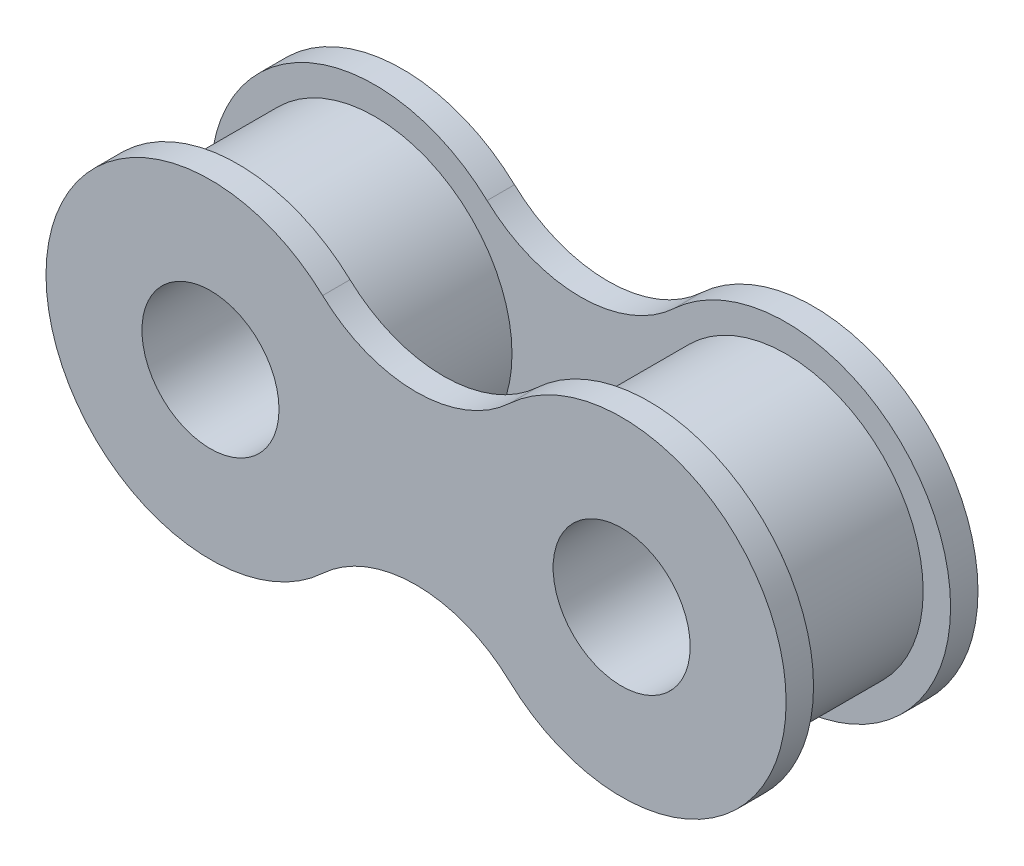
ISO-10303-21;
HEADER;
FILE_DESCRIPTION(('STEP AP214'),'2;1');
FILE_NAME('part.step','',(''),(''),'','','');
FILE_SCHEMA(('AUTOMOTIVE_DESIGN { 1 0 10303 214 1 1 1 1 }'));
ENDSEC;
DATA;
#1=APPLICATION_CONTEXT('core data for automotive mechanical design processes');
#2=APPLICATION_PROTOCOL_DEFINITION('international standard','automotive_design',2000,#1);
#3=PRODUCT_CONTEXT('',#1,'mechanical');
#4=PRODUCT('Part','Part','',(#3));
#5=PRODUCT_RELATED_PRODUCT_CATEGORY('part','',(#4));
#6=PRODUCT_DEFINITION_FORMATION('','',#4);
#7=PRODUCT_DEFINITION_CONTEXT('part definition',#1,'design');
#8=PRODUCT_DEFINITION('design','',#6,#7);
#9=PRODUCT_DEFINITION_SHAPE('','',#8);
#10=(LENGTH_UNIT() NAMED_UNIT(*) SI_UNIT(.MILLI.,.METRE.));
#11=(NAMED_UNIT(*) PLANE_ANGLE_UNIT() SI_UNIT($,.RADIAN.));
#12=(NAMED_UNIT(*) SI_UNIT($,.STERADIAN.) SOLID_ANGLE_UNIT());
#13=UNCERTAINTY_MEASURE_WITH_UNIT(LENGTH_MEASURE(1.E-05),#10,'distance_accuracy_value','');
#14=(GEOMETRIC_REPRESENTATION_CONTEXT(3) GLOBAL_UNCERTAINTY_ASSIGNED_CONTEXT((#13)) GLOBAL_UNIT_ASSIGNED_CONTEXT((#10,
#11,#12)) REPRESENTATION_CONTEXT('',''));
#15=CARTESIAN_POINT('',(0.,0.,0.));
#16=DIRECTION('',(0.,0.,1.));
#17=DIRECTION('',(1.,0.,0.));
#18=AXIS2_PLACEMENT_3D('',#15,#16,#17);
#19=CARTESIAN_POINT('',(0.,0.,-2.5));
#20=DIRECTION('',(0.,0.,1.));
#21=DIRECTION('',(1.,0.,0.));
#22=AXIS2_PLACEMENT_3D('',#19,#20,#21);
#23=CYLINDRICAL_SURFACE('',#22,2.5);
#24=CARTESIAN_POINT('',(0.,0.,3.5));
#25=DIRECTION('',(0.,0.,1.));
#26=DIRECTION('',(1.,0.,0.));
#27=AXIS2_PLACEMENT_3D('',#24,#25,#26);
#28=CIRCLE('',#27,2.5);
#29=CARTESIAN_POINT('',(2.5,0.,3.5));
#30=VERTEX_POINT('',#29);
#31=EDGE_CURVE('E177',#30,#30,#28,.T.);
#32=ORIENTED_EDGE('',*,*,#31,.T.);
#33=EDGE_LOOP('',(#32));
#34=FACE_BOUND('',#33,.T.);
#35=CARTESIAN_POINT('',(0.,0.,-3.5));
#36=DIRECTION('',(0.,0.,1.));
#37=DIRECTION('',(1.,0.,0.));
#38=AXIS2_PLACEMENT_3D('',#35,#36,#37);
#39=CIRCLE('',#38,2.5);
#40=CARTESIAN_POINT('',(2.5,0.,-3.5));
#41=VERTEX_POINT('',#40);
#42=EDGE_CURVE('E141',#41,#41,#39,.T.);
#43=ORIENTED_EDGE('',*,*,#42,.F.);
#44=EDGE_LOOP('',(#43));
#45=FACE_BOUND('',#44,.T.);
#46=ADVANCED_FACE('F37',(#34,#45),#23,.F.);
#47=CARTESIAN_POINT('',(0.,0.,-2.5));
#48=DIRECTION('',(0.,0.,1.));
#49=DIRECTION('',(1.,0.,0.));
#50=AXIS2_PLACEMENT_3D('',#47,#48,#49);
#51=CYLINDRICAL_SURFACE('',#50,5.);
#52=CARTESIAN_POINT('',(0.,0.,-2.5));
#53=DIRECTION('',(0.,0.,-1.));
#54=DIRECTION('',(-1.,0.,0.));
#55=AXIS2_PLACEMENT_3D('',#52,#53,#54);
#56=CIRCLE('',#55,5.);
#57=CARTESIAN_POINT('',(-5.,0.,-2.5));
#58=VERTEX_POINT('',#57);
#59=EDGE_CURVE('E162',#58,#58,#56,.F.);
#60=ORIENTED_EDGE('',*,*,#59,.T.);
#61=EDGE_LOOP('',(#60));
#62=FACE_BOUND('',#61,.T.);
#63=CARTESIAN_POINT('',(0.,0.,2.5));
#64=DIRECTION('',(0.,0.,1.));
#65=DIRECTION('',(1.,0.,0.));
#66=AXIS2_PLACEMENT_3D('',#63,#64,#65);
#67=CIRCLE('',#66,5.);
#68=CARTESIAN_POINT('',(5.,0.,2.5));
#69=VERTEX_POINT('',#68);
#70=EDGE_CURVE('E11',#69,#69,#67,.T.);
#71=ORIENTED_EDGE('',*,*,#70,.F.);
#72=EDGE_LOOP('',(#71));
#73=FACE_BOUND('',#72,.T.);
#74=ADVANCED_FACE('F202',(#62,#73),#51,.T.);
#75=CARTESIAN_POINT('',(7.5,8.04673846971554,3.5));
#76=DIRECTION('',(0.,0.,-1.));
#77=DIRECTION('',(-1.,0.,0.));
#78=AXIS2_PLACEMENT_3D('',#75,#76,#77);
#79=CYLINDRICAL_SURFACE('',#78,5.);
#80=CARTESIAN_POINT('',(7.5,8.04673846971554,2.5));
#81=DIRECTION('',(0.,0.,1.));
#82=DIRECTION('',(1.,0.,0.));
#83=AXIS2_PLACEMENT_3D('',#80,#81,#82);
#84=CIRCLE('',#83,5.);
#85=CARTESIAN_POINT('',(4.09090909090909,4.3891300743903,2.5));
#86=VERTEX_POINT('',#85);
#87=CARTESIAN_POINT('',(10.9090909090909,4.3891300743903,2.5));
#88=VERTEX_POINT('',#87);
#89=EDGE_CURVE('E168',#86,#88,#84,.T.);
#90=ORIENTED_EDGE('',*,*,#89,.F.);
#91=DIRECTION('',(0.,0.,-1.));
#92=VECTOR('',#91,1.);
#93=CARTESIAN_POINT('',(4.09090909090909,4.3891300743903,3.5));
#94=LINE('',#93,#92);
#95=CARTESIAN_POINT('',(4.09090909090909,4.3891300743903,3.5));
#96=VERTEX_POINT('',#95);
#97=EDGE_CURVE('E45',#96,#86,#94,.T.);
#98=ORIENTED_EDGE('',*,*,#97,.F.);
#99=CARTESIAN_POINT('',(7.5,8.04673846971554,3.5));
#100=DIRECTION('',(0.,0.,1.));
#101=DIRECTION('',(1.,0.,0.));
#102=AXIS2_PLACEMENT_3D('',#99,#100,#101);
#103=CIRCLE('',#102,5.);
#104=CARTESIAN_POINT('',(10.9090909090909,4.3891300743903,3.5));
#105=VERTEX_POINT('',#104);
#106=EDGE_CURVE('E169',#96,#105,#103,.T.);
#107=ORIENTED_EDGE('',*,*,#106,.T.);
#108=DIRECTION('',(0.,0.,-1.));
#109=VECTOR('',#108,1.);
#110=CARTESIAN_POINT('',(10.9090909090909,4.3891300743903,3.5));
#111=LINE('',#110,#109);
#112=EDGE_CURVE('E78',#105,#88,#111,.T.);
#113=ORIENTED_EDGE('',*,*,#112,.T.);
#114=EDGE_LOOP('',(#90,#98,#107,#113));
#115=FACE_BOUND('',#114,.T.);
#116=ADVANCED_FACE('F200',(#115),#79,.F.);
#117=CARTESIAN_POINT('',(0.,0.,3.5));
#118=DIRECTION('',(0.,0.,-1.));
#119=DIRECTION('',(-1.,0.,0.));
#120=AXIS2_PLACEMENT_3D('',#117,#118,#119);
#121=CYLINDRICAL_SURFACE('',#120,6.);
#122=CARTESIAN_POINT('',(0.,0.,2.5));
#123=DIRECTION('',(0.,0.,1.));
#124=DIRECTION('',(1.,0.,0.));
#125=AXIS2_PLACEMENT_3D('',#122,#123,#124);
#126=CIRCLE('',#125,6.);
#127=CARTESIAN_POINT('',(4.09090909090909,-4.3891300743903,2.5));
#128=VERTEX_POINT('',#127);
#129=EDGE_CURVE('E185',#86,#128,#126,.T.);
#130=ORIENTED_EDGE('',*,*,#129,.T.);
#131=DIRECTION('',(0.,0.,-1.));
#132=VECTOR('',#131,1.);
#133=CARTESIAN_POINT('',(4.09090909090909,-4.3891300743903,3.5));
#134=LINE('',#133,#132);
#135=CARTESIAN_POINT('',(4.09090909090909,-4.3891300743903,3.5));
#136=VERTEX_POINT('',#135);
#137=EDGE_CURVE('E192',#136,#128,#134,.T.);
#138=ORIENTED_EDGE('',*,*,#137,.F.);
#139=CARTESIAN_POINT('',(0.,0.,3.5));
#140=DIRECTION('',(0.,0.,1.));
#141=DIRECTION('',(1.,0.,0.));
#142=AXIS2_PLACEMENT_3D('',#139,#140,#141);
#143=CIRCLE('',#142,6.);
#144=EDGE_CURVE('E171',#96,#136,#143,.T.);
#145=ORIENTED_EDGE('',*,*,#144,.F.);
#146=ORIENTED_EDGE('',*,*,#97,.T.);
#147=EDGE_LOOP('',(#130,#138,#145,#146));
#148=FACE_BOUND('',#147,.T.);
#149=ADVANCED_FACE('F195',(#148),#121,.T.);
#150=CARTESIAN_POINT('',(7.5,-8.04673846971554,3.5));
#151=DIRECTION('',(0.,0.,-1.));
#152=DIRECTION('',(-1.,0.,0.));
#153=AXIS2_PLACEMENT_3D('',#150,#151,#152);
#154=CYLINDRICAL_SURFACE('',#153,5.);
#155=CARTESIAN_POINT('',(7.5,-8.04673846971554,2.5));
#156=DIRECTION('',(0.,0.,1.));
#157=DIRECTION('',(1.,0.,0.));
#158=AXIS2_PLACEMENT_3D('',#155,#156,#157);
#159=CIRCLE('',#158,5.);
#160=CARTESIAN_POINT('',(10.9090909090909,-4.3891300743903,2.5));
#161=VERTEX_POINT('',#160);
#162=EDGE_CURVE('E71',#128,#161,#159,.F.);
#163=ORIENTED_EDGE('',*,*,#162,.T.);
#164=DIRECTION('',(0.,0.,-1.));
#165=VECTOR('',#164,1.);
#166=CARTESIAN_POINT('',(10.9090909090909,-4.3891300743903,3.5));
#167=LINE('',#166,#165);
#168=CARTESIAN_POINT('',(10.9090909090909,-4.3891300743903,3.5));
#169=VERTEX_POINT('',#168);
#170=EDGE_CURVE('E190',#169,#161,#167,.T.);
#171=ORIENTED_EDGE('',*,*,#170,.F.);
#172=CARTESIAN_POINT('',(7.5,-8.04673846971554,3.5));
#173=DIRECTION('',(0.,0.,1.));
#174=DIRECTION('',(1.,0.,0.));
#175=AXIS2_PLACEMENT_3D('',#172,#173,#174);
#176=CIRCLE('',#175,5.);
#177=EDGE_CURVE('E174',#136,#169,#176,.F.);
#178=ORIENTED_EDGE('',*,*,#177,.F.);
#179=ORIENTED_EDGE('',*,*,#137,.T.);
#180=EDGE_LOOP('',(#163,#171,#178,#179));
#181=FACE_BOUND('',#180,.T.);
#182=ADVANCED_FACE('F208',(#181),#154,.F.);
#183=CARTESIAN_POINT('',(15.,0.,3.5));
#184=DIRECTION('',(0.,0.,-1.));
#185=DIRECTION('',(-1.,0.,0.));
#186=AXIS2_PLACEMENT_3D('',#183,#184,#185);
#187=CYLINDRICAL_SURFACE('',#186,6.);
#188=CARTESIAN_POINT('',(15.,0.,2.5));
#189=DIRECTION('',(0.,0.,1.));
#190=DIRECTION('',(1.,0.,0.));
#191=AXIS2_PLACEMENT_3D('',#188,#189,#190);
#192=CIRCLE('',#191,6.);
#193=EDGE_CURVE('E172',#161,#88,#192,.T.);
#194=ORIENTED_EDGE('',*,*,#193,.T.);
#195=ORIENTED_EDGE('',*,*,#112,.F.);
#196=CARTESIAN_POINT('',(15.,0.,3.5));
#197=DIRECTION('',(0.,0.,1.));
#198=DIRECTION('',(1.,0.,0.));
#199=AXIS2_PLACEMENT_3D('',#196,#197,#198);
#200=CIRCLE('',#199,6.);
#201=EDGE_CURVE('E53',#169,#105,#200,.T.);
#202=ORIENTED_EDGE('',*,*,#201,.F.);
#203=ORIENTED_EDGE('',*,*,#170,.T.);
#204=EDGE_LOOP('',(#194,#195,#202,#203));
#205=FACE_BOUND('',#204,.T.);
#206=ADVANCED_FACE('F228',(#205),#187,.T.);
#207=CARTESIAN_POINT('',(15.,0.,3.5));
#208=DIRECTION('',(0.,0.,-1.));
#209=DIRECTION('',(-1.,0.,0.));
#210=AXIS2_PLACEMENT_3D('',#207,#208,#209);
#211=CYLINDRICAL_SURFACE('',#210,2.49999999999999);
#212=CARTESIAN_POINT('',(15.,0.,3.5));
#213=DIRECTION('',(0.,0.,1.));
#214=DIRECTION('',(1.,0.,0.));
#215=AXIS2_PLACEMENT_3D('',#212,#213,#214);
#216=CIRCLE('',#215,2.49999999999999);
#217=CARTESIAN_POINT('',(17.5,0.,3.5));
#218=VERTEX_POINT('',#217);
#219=EDGE_CURVE('E180',#218,#218,#216,.T.);
#220=ORIENTED_EDGE('',*,*,#219,.T.);
#221=EDGE_LOOP('',(#220));
#222=FACE_BOUND('',#221,.T.);
#223=CARTESIAN_POINT('',(15.,0.,-3.5));
#224=DIRECTION('',(0.,0.,1.));
#225=DIRECTION('',(1.,0.,0.));
#226=AXIS2_PLACEMENT_3D('',#223,#224,#225);
#227=CIRCLE('',#226,2.49999999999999);
#228=CARTESIAN_POINT('',(17.5,0.,-3.5));
#229=VERTEX_POINT('',#228);
#230=EDGE_CURVE('E144',#229,#229,#227,.T.);
#231=ORIENTED_EDGE('',*,*,#230,.F.);
#232=EDGE_LOOP('',(#231));
#233=FACE_BOUND('',#232,.T.);
#234=ADVANCED_FACE('F225',(#222,#233),#211,.F.);
#235=CARTESIAN_POINT('',(7.5,-23.1232620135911,3.5));
#236=DIRECTION('',(0.,0.,1.));
#237=DIRECTION('',(1.,0.,0.));
#238=AXIS2_PLACEMENT_3D('',#235,#236,#237);
#239=PLANE('',#238);
#240=ORIENTED_EDGE('',*,*,#106,.F.);
#241=ORIENTED_EDGE('',*,*,#144,.T.);
#242=ORIENTED_EDGE('',*,*,#177,.T.);
#243=ORIENTED_EDGE('',*,*,#201,.T.);
#244=EDGE_LOOP('',(#240,#241,#242,#243));
#245=FACE_BOUND('',#244,.T.);
#246=ORIENTED_EDGE('',*,*,#31,.F.);
#247=EDGE_LOOP('',(#246));
#248=FACE_BOUND('',#247,.T.);
#249=ORIENTED_EDGE('',*,*,#219,.F.);
#250=EDGE_LOOP('',(#249));
#251=FACE_BOUND('',#250,.T.);
#252=ADVANCED_FACE('F227',(#245,#248,#251),#239,.T.);
#253=CARTESIAN_POINT('',(7.5,-23.1232620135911,2.5));
#254=DIRECTION('',(0.,0.,1.));
#255=DIRECTION('',(1.,0.,0.));
#256=AXIS2_PLACEMENT_3D('',#253,#254,#255);
#257=PLANE('',#256);
#258=CARTESIAN_POINT('',(15.,0.,2.5));
#259=DIRECTION('',(0.,0.,1.));
#260=DIRECTION('',(1.,0.,0.));
#261=AXIS2_PLACEMENT_3D('',#258,#259,#260);
#262=CIRCLE('',#261,5.);
#263=CARTESIAN_POINT('',(20.,0.,2.5));
#264=VERTEX_POINT('',#263);
#265=EDGE_CURVE('E165',#264,#264,#262,.T.);
#266=ORIENTED_EDGE('',*,*,#265,.T.);
#267=EDGE_LOOP('',(#266));
#268=FACE_BOUND('',#267,.T.);
#269=ORIENTED_EDGE('',*,*,#70,.T.);
#270=EDGE_LOOP('',(#269));
#271=FACE_BOUND('',#270,.T.);
#272=ORIENTED_EDGE('',*,*,#89,.T.);
#273=ORIENTED_EDGE('',*,*,#193,.F.);
#274=ORIENTED_EDGE('',*,*,#162,.F.);
#275=ORIENTED_EDGE('',*,*,#129,.F.);
#276=EDGE_LOOP('',(#272,#273,#274,#275));
#277=FACE_BOUND('',#276,.T.);
#278=ADVANCED_FACE('F198',(#268,#271,#277),#257,.F.);
#279=CARTESIAN_POINT('',(15.,0.,-2.5));
#280=DIRECTION('',(0.,0.,1.));
#281=DIRECTION('',(1.,0.,0.));
#282=AXIS2_PLACEMENT_3D('',#279,#280,#281);
#283=CYLINDRICAL_SURFACE('',#282,5.);
#284=CARTESIAN_POINT('',(15.,0.,-2.5));
#285=DIRECTION('',(0.,0.,-1.));
#286=DIRECTION('',(-1.,0.,0.));
#287=AXIS2_PLACEMENT_3D('',#284,#285,#286);
#288=CIRCLE('',#287,5.);
#289=CARTESIAN_POINT('',(9.99999999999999,0.,-2.5));
#290=VERTEX_POINT('',#289);
#291=EDGE_CURVE('E132',#290,#290,#288,.F.);
#292=ORIENTED_EDGE('',*,*,#291,.T.);
#293=EDGE_LOOP('',(#292));
#294=FACE_BOUND('',#293,.T.);
#295=ORIENTED_EDGE('',*,*,#265,.F.);
#296=EDGE_LOOP('',(#295));
#297=FACE_BOUND('',#296,.T.);
#298=ADVANCED_FACE('F267',(#294,#297),#283,.T.);
#299=CARTESIAN_POINT('',(7.5,8.04673846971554,-3.5));
#300=DIRECTION('',(0.,0.,1.));
#301=DIRECTION('',(1.,0.,0.));
#302=AXIS2_PLACEMENT_3D('',#299,#300,#301);
#303=CYLINDRICAL_SURFACE('',#302,5.);
#304=CARTESIAN_POINT('',(7.5,8.04673846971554,-2.5));
#305=DIRECTION('',(0.,0.,1.));
#306=DIRECTION('',(1.,0.,0.));
#307=AXIS2_PLACEMENT_3D('',#304,#305,#306);
#308=CIRCLE('',#307,5.);
#309=CARTESIAN_POINT('',(4.09090909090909,4.3891300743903,-2.5));
#310=VERTEX_POINT('',#309);
#311=CARTESIAN_POINT('',(10.9090909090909,4.3891300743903,-2.5));
#312=VERTEX_POINT('',#311);
#313=EDGE_CURVE('E128',#310,#312,#308,.T.);
#314=ORIENTED_EDGE('',*,*,#313,.T.);
#315=DIRECTION('',(0.,0.,1.));
#316=VECTOR('',#315,1.);
#317=CARTESIAN_POINT('',(10.9090909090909,4.3891300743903,-3.5));
#318=LINE('',#317,#316);
#319=CARTESIAN_POINT('',(10.9090909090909,4.3891300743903,-3.5));
#320=VERTEX_POINT('',#319);
#321=EDGE_CURVE('E125',#320,#312,#318,.T.);
#322=ORIENTED_EDGE('',*,*,#321,.F.);
#323=CARTESIAN_POINT('',(7.5,8.04673846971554,-3.5));
#324=DIRECTION('',(0.,0.,1.));
#325=DIRECTION('',(1.,0.,0.));
#326=AXIS2_PLACEMENT_3D('',#323,#324,#325);
#327=CIRCLE('',#326,5.);
#328=CARTESIAN_POINT('',(4.09090909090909,4.3891300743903,-3.5));
#329=VERTEX_POINT('',#328);
#330=EDGE_CURVE('E111',#329,#320,#327,.T.);
#331=ORIENTED_EDGE('',*,*,#330,.F.);
#332=DIRECTION('',(0.,0.,1.));
#333=VECTOR('',#332,1.);
#334=CARTESIAN_POINT('',(4.09090909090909,4.3891300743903,-3.5));
#335=LINE('',#334,#333);
#336=EDGE_CURVE('E147',#329,#310,#335,.T.);
#337=ORIENTED_EDGE('',*,*,#336,.T.);
#338=EDGE_LOOP('',(#314,#322,#331,#337));
#339=FACE_BOUND('',#338,.T.);
#340=ADVANCED_FACE('F126',(#339),#303,.F.);
#341=CARTESIAN_POINT('',(15.,0.,-3.5));
#342=DIRECTION('',(0.,0.,1.));
#343=DIRECTION('',(1.,0.,0.));
#344=AXIS2_PLACEMENT_3D('',#341,#342,#343);
#345=CYLINDRICAL_SURFACE('',#344,6.);
#346=CARTESIAN_POINT('',(15.,0.,-2.5));
#347=DIRECTION('',(0.,0.,1.));
#348=DIRECTION('',(1.,0.,0.));
#349=AXIS2_PLACEMENT_3D('',#346,#347,#348);
#350=CIRCLE('',#349,6.);
#351=CARTESIAN_POINT('',(10.9090909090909,-4.3891300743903,-2.5));
#352=VERTEX_POINT('',#351);
#353=EDGE_CURVE('E149',#352,#312,#350,.T.);
#354=ORIENTED_EDGE('',*,*,#353,.F.);
#355=DIRECTION('',(0.,0.,1.));
#356=VECTOR('',#355,1.);
#357=CARTESIAN_POINT('',(10.9090909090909,-4.3891300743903,-3.5));
#358=LINE('',#357,#356);
#359=CARTESIAN_POINT('',(10.9090909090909,-4.3891300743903,-3.5));
#360=VERTEX_POINT('',#359);
#361=EDGE_CURVE('E133',#360,#352,#358,.T.);
#362=ORIENTED_EDGE('',*,*,#361,.F.);
#363=CARTESIAN_POINT('',(15.,0.,-3.5));
#364=DIRECTION('',(0.,0.,1.));
#365=DIRECTION('',(1.,0.,0.));
#366=AXIS2_PLACEMENT_3D('',#363,#364,#365);
#367=CIRCLE('',#366,6.);
#368=EDGE_CURVE('E117',#360,#320,#367,.T.);
#369=ORIENTED_EDGE('',*,*,#368,.T.);
#370=ORIENTED_EDGE('',*,*,#321,.T.);
#371=EDGE_LOOP('',(#354,#362,#369,#370));
#372=FACE_BOUND('',#371,.T.);
#373=ADVANCED_FACE('F135',(#372),#345,.T.);
#374=CARTESIAN_POINT('',(7.5,-8.04673846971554,-3.5));
#375=DIRECTION('',(0.,0.,1.));
#376=DIRECTION('',(1.,0.,0.));
#377=AXIS2_PLACEMENT_3D('',#374,#375,#376);
#378=CYLINDRICAL_SURFACE('',#377,5.);
#379=CARTESIAN_POINT('',(7.5,-8.04673846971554,-2.5));
#380=DIRECTION('',(0.,0.,1.));
#381=DIRECTION('',(1.,0.,0.));
#382=AXIS2_PLACEMENT_3D('',#379,#380,#381);
#383=CIRCLE('',#382,5.);
#384=CARTESIAN_POINT('',(4.09090909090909,-4.3891300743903,-2.5));
#385=VERTEX_POINT('',#384);
#386=EDGE_CURVE('E151',#385,#352,#383,.F.);
#387=ORIENTED_EDGE('',*,*,#386,.F.);
#388=DIRECTION('',(0.,0.,1.));
#389=VECTOR('',#388,1.);
#390=CARTESIAN_POINT('',(4.09090909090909,-4.3891300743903,-3.5));
#391=LINE('',#390,#389);
#392=CARTESIAN_POINT('',(4.09090909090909,-4.3891300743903,-3.5));
#393=VERTEX_POINT('',#392);
#394=EDGE_CURVE('E157',#393,#385,#391,.T.);
#395=ORIENTED_EDGE('',*,*,#394,.F.);
#396=CARTESIAN_POINT('',(7.5,-8.04673846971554,-3.5));
#397=DIRECTION('',(0.,0.,1.));
#398=DIRECTION('',(1.,0.,0.));
#399=AXIS2_PLACEMENT_3D('',#396,#397,#398);
#400=CIRCLE('',#399,5.);
#401=EDGE_CURVE('E136',#393,#360,#400,.F.);
#402=ORIENTED_EDGE('',*,*,#401,.T.);
#403=ORIENTED_EDGE('',*,*,#361,.T.);
#404=EDGE_LOOP('',(#387,#395,#402,#403));
#405=FACE_BOUND('',#404,.T.);
#406=ADVANCED_FACE('F305',(#405),#378,.F.);
#407=CARTESIAN_POINT('',(0.,0.,-3.5));
#408=DIRECTION('',(0.,0.,1.));
#409=DIRECTION('',(1.,0.,0.));
#410=AXIS2_PLACEMENT_3D('',#407,#408,#409);
#411=CYLINDRICAL_SURFACE('',#410,6.);
#412=CARTESIAN_POINT('',(0.,0.,-2.5));
#413=DIRECTION('',(0.,0.,1.));
#414=DIRECTION('',(1.,0.,0.));
#415=AXIS2_PLACEMENT_3D('',#412,#413,#414);
#416=CIRCLE('',#415,6.);
#417=EDGE_CURVE('E122',#310,#385,#416,.T.);
#418=ORIENTED_EDGE('',*,*,#417,.F.);
#419=ORIENTED_EDGE('',*,*,#336,.F.);
#420=CARTESIAN_POINT('',(0.,0.,-3.5));
#421=DIRECTION('',(0.,0.,1.));
#422=DIRECTION('',(1.,0.,0.));
#423=AXIS2_PLACEMENT_3D('',#420,#421,#422);
#424=CIRCLE('',#423,6.);
#425=EDGE_CURVE('E120',#329,#393,#424,.T.);
#426=ORIENTED_EDGE('',*,*,#425,.T.);
#427=ORIENTED_EDGE('',*,*,#394,.T.);
#428=EDGE_LOOP('',(#418,#419,#426,#427));
#429=FACE_BOUND('',#428,.T.);
#430=ADVANCED_FACE('F221',(#429),#411,.T.);
#431=CARTESIAN_POINT('',(7.5,-23.1232620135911,-3.5));
#432=DIRECTION('',(0.,0.,-1.));
#433=DIRECTION('',(1.,0.,0.));
#434=AXIS2_PLACEMENT_3D('',#431,#432,#433);
#435=PLANE('',#434);
#436=ORIENTED_EDGE('',*,*,#330,.T.);
#437=ORIENTED_EDGE('',*,*,#368,.F.);
#438=ORIENTED_EDGE('',*,*,#401,.F.);
#439=ORIENTED_EDGE('',*,*,#425,.F.);
#440=EDGE_LOOP('',(#436,#437,#438,#439));
#441=FACE_BOUND('',#440,.T.);
#442=ORIENTED_EDGE('',*,*,#42,.T.);
#443=EDGE_LOOP('',(#442));
#444=FACE_BOUND('',#443,.T.);
#445=ORIENTED_EDGE('',*,*,#230,.T.);
#446=EDGE_LOOP('',(#445));
#447=FACE_BOUND('',#446,.T.);
#448=ADVANCED_FACE('F113',(#441,#444,#447),#435,.T.);
#449=CARTESIAN_POINT('',(7.5,-23.1232620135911,-2.5));
#450=DIRECTION('',(0.,0.,-1.));
#451=DIRECTION('',(1.,0.,0.));
#452=AXIS2_PLACEMENT_3D('',#449,#450,#451);
#453=PLANE('',#452);
#454=ORIENTED_EDGE('',*,*,#59,.F.);
#455=EDGE_LOOP('',(#454));
#456=FACE_BOUND('',#455,.T.);
#457=ORIENTED_EDGE('',*,*,#291,.F.);
#458=EDGE_LOOP('',(#457));
#459=FACE_BOUND('',#458,.T.);
#460=ORIENTED_EDGE('',*,*,#313,.F.);
#461=ORIENTED_EDGE('',*,*,#417,.T.);
#462=ORIENTED_EDGE('',*,*,#386,.T.);
#463=ORIENTED_EDGE('',*,*,#353,.T.);
#464=EDGE_LOOP('',(#460,#461,#462,#463));
#465=FACE_BOUND('',#464,.T.);
#466=ADVANCED_FACE('F220',(#456,#459,#465),#453,.F.);
#467=CLOSED_SHELL('',(#46,#74,#116,#149,#182,#206,#234,#252,#278,#298,#340,#373,#406,#430,#448,#466));
#468=MANIFOLD_SOLID_BREP('B2',#467);
#469=ADVANCED_BREP_SHAPE_REPRESENTATION('',(#18,#468),#14);
#470=SHAPE_DEFINITION_REPRESENTATION(#9,#469);
ENDSEC;
END-ISO-10303-21;
